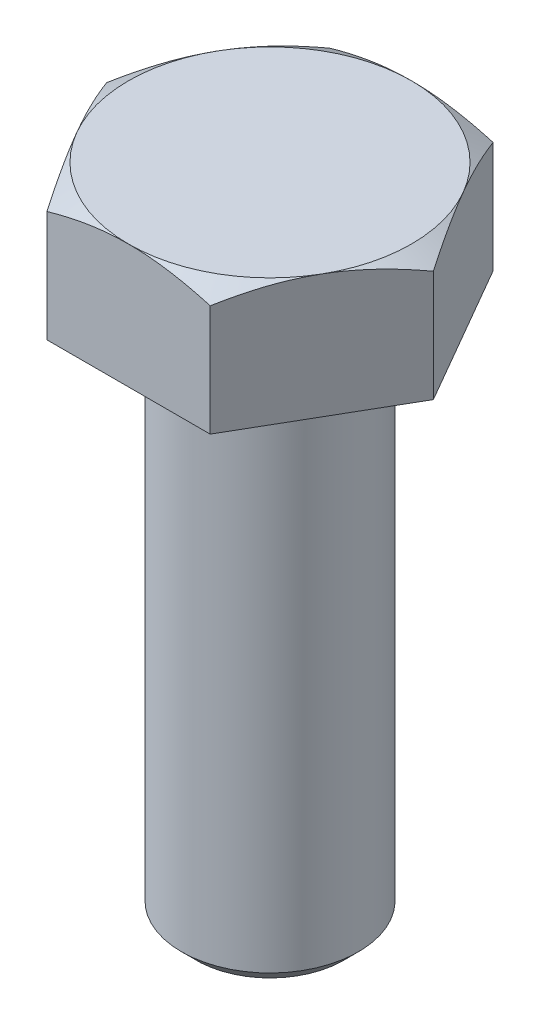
from build123d import *

# Parameters (mm, degrees)
BOSS_EXTRUDE1_DEPTH = 4.2
SKETCH2_OUTSIDE_W   = 40.386
SKETCH2_OUTSIDE_H   = 38.9
SKETCH2_OUTSIDE_R   = 4.8
CUT_EXTRUDE1_DEPTH  = 7
CUT_EXTRUDE1_DRAFT  = -60
SKETCH3_R           = 3
BOSS_EXTRUDE2_DEPTH = 18
SKETCH4_OUTSIDE_W   = 38.408
SKETCH4_OUTSIDE_H   = 36.922
SKETCH4_OUTSIDE_R   = 2.5
CUT_EXTRUDE2_DEPTH  = 10
CUT_EXTRUDE2_DRAFT  = -45


with BuildPart() as part:
    # Sketch1 → Boss-Extrude1 (new body)
    with BuildSketch(Plane(origin=(0, 0, 0), x_dir=(1, 0, 0), z_dir=(0, 1, 0))):
        Polygon((5.542562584, 0), (2.771281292, 4.8), (-2.771281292, 4.8), (-5.542562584, 0), (-2.771281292, -4.8), (2.771281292, -4.8), align=None)
    extrude(amount=BOSS_EXTRUDE1_DEPTH)


with BuildPart() as cut_extrude1_tool:
    # Sketch2 outside → Cut-Extrude1 (with draft: the straight prism first)
    with BuildSketch(Plane(origin=(0, 4.2, 0), x_dir=(1, 0, 0), z_dir=(0, 1, 0))):
        Rectangle(SKETCH2_OUTSIDE_W, SKETCH2_OUTSIDE_H)
        Circle(SKETCH2_OUTSIDE_R, mode=Mode.SUBTRACT)
    extrude(amount=-CUT_EXTRUDE1_DEPTH)
    # Cut-Extrude1: the draft: its side faces are tilted about the plane it starts from
    cut_extrude1_sides = [cut_extrude1_tool.faces().sort_by_distance(p)[0] for p in [
        (0, 0.7, 19.45),
        (20.193, 0.7, 0),
        (0, 0.7, -19.45),
        (-20.193, 0.7, 0),
        (-4.8, 0.7, 0),
    ]]
    draft(cut_extrude1_sides, Plane(origin=(0, 4.2, 0), x_dir=(1, 0, 0), z_dir=(0, 1, 0)), CUT_EXTRUDE1_DRAFT)


with BuildPart() as part_1:
    add(part.part)

    # Cut-Extrude1: cut by cut_extrude1_tool
    add(cut_extrude1_tool.part, mode=Mode.SUBTRACT)

    # Sketch3 → Boss-Extrude2 (add)
    with BuildSketch(Plane.XZ):
        with Locations(Location((0, 0, 0), (0, 0, 90))):
            Circle(SKETCH3_R)
    extrude(amount=BOSS_EXTRUDE2_DEPTH)


with BuildPart() as cut_extrude2_tool:
    # Sketch4 outside → Cut-Extrude2 (with draft: the straight prism first)
    with BuildSketch(Plane.XZ.offset(18)):
        Rectangle(SKETCH4_OUTSIDE_W, SKETCH4_OUTSIDE_H)
        Circle(SKETCH4_OUTSIDE_R, mode=Mode.SUBTRACT)
    extrude(amount=-CUT_EXTRUDE2_DEPTH)
    # Cut-Extrude2: the draft: its side faces are tilted about the plane it starts from
    cut_extrude2_sides = [cut_extrude2_tool.faces().sort_by_distance(p)[0] for p in [
        (0, -13, -18.461),
        (19.204, -13, 0),
        (0, -13, 18.461),
        (-19.204, -13, 0),
        (-2.5, -13, 0),
    ]]
    draft(cut_extrude2_sides, Plane.XZ.offset(18), CUT_EXTRUDE2_DRAFT)


with BuildPart() as part_2:
    add(part_1.part)

    # Cut-Extrude2: cut by cut_extrude2_tool
    add(cut_extrude2_tool.part, mode=Mode.SUBTRACT)


solid = part_2.part
